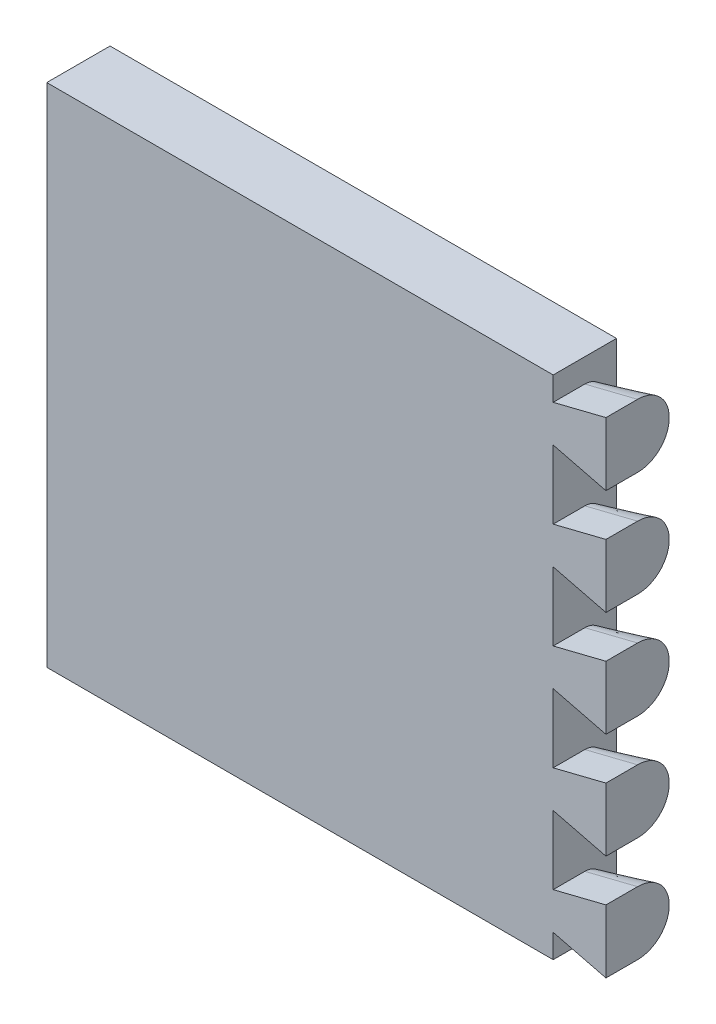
ISO-10303-21;
HEADER;
FILE_DESCRIPTION(('STEP AP214'),'2;1');
FILE_NAME('part.step','',(''),(''),'','','');
FILE_SCHEMA(('AUTOMOTIVE_DESIGN { 1 0 10303 214 1 1 1 1 }'));
ENDSEC;
DATA;
#1=APPLICATION_CONTEXT('core data for automotive mechanical design processes');
#2=APPLICATION_PROTOCOL_DEFINITION('international standard','automotive_design',2000,#1);
#3=PRODUCT_CONTEXT('',#1,'mechanical');
#4=PRODUCT('Part','Part','',(#3));
#5=PRODUCT_RELATED_PRODUCT_CATEGORY('part','',(#4));
#6=PRODUCT_DEFINITION_FORMATION('','',#4);
#7=PRODUCT_DEFINITION_CONTEXT('part definition',#1,'design');
#8=PRODUCT_DEFINITION('design','',#6,#7);
#9=PRODUCT_DEFINITION_SHAPE('','',#8);
#10=(LENGTH_UNIT() NAMED_UNIT(*) SI_UNIT(.MILLI.,.METRE.));
#11=(NAMED_UNIT(*) PLANE_ANGLE_UNIT() SI_UNIT($,.RADIAN.));
#12=(NAMED_UNIT(*) SI_UNIT($,.STERADIAN.) SOLID_ANGLE_UNIT());
#13=UNCERTAINTY_MEASURE_WITH_UNIT(LENGTH_MEASURE(1.E-05),#10,'distance_accuracy_value','');
#14=(GEOMETRIC_REPRESENTATION_CONTEXT(3) GLOBAL_UNCERTAINTY_ASSIGNED_CONTEXT((#13)) GLOBAL_UNIT_ASSIGNED_CONTEXT((#10,
#11,#12)) REPRESENTATION_CONTEXT('',''));
#15=CARTESIAN_POINT('',(0.,0.,0.));
#16=DIRECTION('',(0.,0.,1.));
#17=DIRECTION('',(1.,0.,0.));
#18=AXIS2_PLACEMENT_3D('',#15,#16,#17);
#19=CARTESIAN_POINT('',(76.2,-76.2,-9.52500000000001));
#20=DIRECTION('',(1.,0.,0.));
#21=DIRECTION('',(0.,0.,-1.));
#22=AXIS2_PLACEMENT_3D('',#19,#20,#21);
#23=PLANE('',#22);
#24=DIRECTION('',(0.,0.,1.));
#25=VECTOR('',#24,1.);
#26=CARTESIAN_POINT('',(76.2,-69.0669179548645,9.52499999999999));
#27=LINE('',#26,#25);
#28=CARTESIAN_POINT('',(76.2,-69.0669179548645,0.));
#29=VERTEX_POINT('',#28);
#30=CARTESIAN_POINT('',(76.2,-69.0669179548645,9.52499999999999));
#31=VERTEX_POINT('',#30);
#32=EDGE_CURVE('E246',#29,#31,#27,.T.);
#33=ORIENTED_EDGE('',*,*,#32,.T.);
#34=DIRECTION('',(0.,1.,0.));
#35=VECTOR('',#34,1.);
#36=CARTESIAN_POINT('',(76.2,-76.2,9.52499999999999));
#37=LINE('',#36,#35);
#38=CARTESIAN_POINT('',(76.2,-76.2,9.52499999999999));
#39=VERTEX_POINT('',#38);
#40=EDGE_CURVE('E243',#39,#31,#37,.T.);
#41=ORIENTED_EDGE('',*,*,#40,.F.);
#42=DIRECTION('',(0.,0.,-1.));
#43=VECTOR('',#42,1.);
#44=CARTESIAN_POINT('',(76.2,-76.2,9.52499999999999));
#45=LINE('',#44,#43);
#46=CARTESIAN_POINT('',(76.2,-76.2,-9.52500000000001));
#47=VERTEX_POINT('',#46);
#48=EDGE_CURVE('E335',#39,#47,#45,.T.);
#49=ORIENTED_EDGE('',*,*,#48,.T.);
#50=DIRECTION('',(0.,-1.,0.));
#51=VECTOR('',#50,1.);
#52=CARTESIAN_POINT('',(76.2,76.2,-9.525));
#53=LINE('',#52,#51);
#54=CARTESIAN_POINT('',(76.2,-63.5,-9.52500000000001));
#55=VERTEX_POINT('',#54);
#56=EDGE_CURVE('E332',#55,#47,#53,.T.);
#57=ORIENTED_EDGE('',*,*,#56,.F.);
#58=CARTESIAN_POINT('',(76.2,-63.5,-9.52500000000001));
#59=DIRECTION('',(0.,0.,1.));
#60=VECTOR('',#59,1.);
#61=LINE('',#58,#60);
#62=CARTESIAN_POINT('',(76.2,-63.5,-5.5669179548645));
#63=VERTEX_POINT('',#62);
#64=EDGE_CURVE('E11',#55,#63,#61,.T.);
#65=ORIENTED_EDGE('',*,*,#64,.T.);
#66=CARTESIAN_POINT('',(76.2,-63.5,0.));
#67=DIRECTION('',(1.,0.,0.));
#68=DIRECTION('',(0.,0.,-1.));
#69=AXIS2_PLACEMENT_3D('',#66,#67,#68);
#70=CIRCLE('',#69,5.5669179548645);
#71=EDGE_CURVE('E808',#63,#29,#70,.F.);
#72=ORIENTED_EDGE('',*,*,#71,.T.);
#73=EDGE_LOOP('',(#33,#41,#49,#57,#65,#72));
#74=FACE_BOUND('',#73,.T.);
#75=ADVANCED_FACE('F32',(#74),#23,.T.);
#76=CARTESIAN_POINT('',(76.2,-63.5,0.));
#77=DIRECTION('',(1.,0.,0.));
#78=DIRECTION('',(0.,0.,-1.));
#79=AXIS2_PLACEMENT_3D('',#76,#77,#78);
#80=CIRCLE('',#79,5.5669179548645);
#81=CARTESIAN_POINT('',(76.2,-57.9330820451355,0.));
#82=VERTEX_POINT('',#81);
#83=EDGE_CURVE('E52',#82,#63,#80,.F.);
#84=ORIENTED_EDGE('',*,*,#83,.T.);
#85=ORIENTED_EDGE('',*,*,#64,.F.);
#86=CARTESIAN_POINT('',(76.2,-31.75,-9.52500000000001));
#87=VERTEX_POINT('',#86);
#88=EDGE_CURVE('E360',#87,#55,#53,.T.);
#89=ORIENTED_EDGE('',*,*,#88,.F.);
#90=CARTESIAN_POINT('',(76.2,-31.75,-9.52500000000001));
#91=DIRECTION('',(0.,0.,1.));
#92=VECTOR('',#91,1.);
#93=LINE('',#90,#92);
#94=CARTESIAN_POINT('',(76.2,-31.75,-5.5669179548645));
#95=VERTEX_POINT('',#94);
#96=EDGE_CURVE('E44',#87,#95,#93,.T.);
#97=ORIENTED_EDGE('',*,*,#96,.T.);
#98=CARTESIAN_POINT('',(76.2,-31.75,0.));
#99=DIRECTION('',(1.,0.,0.));
#100=DIRECTION('',(0.,0.,-1.));
#101=AXIS2_PLACEMENT_3D('',#98,#99,#100);
#102=CIRCLE('',#101,5.5669179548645);
#103=CARTESIAN_POINT('',(76.2,-37.3169179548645,0.));
#104=VERTEX_POINT('',#103);
#105=EDGE_CURVE('E366',#95,#104,#102,.F.);
#106=ORIENTED_EDGE('',*,*,#105,.T.);
#107=DIRECTION('',(0.,0.,1.));
#108=VECTOR('',#107,1.);
#109=CARTESIAN_POINT('',(76.2,-37.3169179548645,9.52499999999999));
#110=LINE('',#109,#108);
#111=CARTESIAN_POINT('',(76.2,-37.3169179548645,9.52499999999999));
#112=VERTEX_POINT('',#111);
#113=EDGE_CURVE('E371',#104,#112,#110,.T.);
#114=ORIENTED_EDGE('',*,*,#113,.T.);
#115=CARTESIAN_POINT('',(76.2,-57.9330820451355,9.52499999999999));
#116=VERTEX_POINT('',#115);
#117=EDGE_CURVE('E467',#116,#112,#37,.T.);
#118=ORIENTED_EDGE('',*,*,#117,.F.);
#119=DIRECTION('',(0.,0.,-1.));
#120=VECTOR('',#119,1.);
#121=CARTESIAN_POINT('',(76.2,-57.9330820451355,9.52499999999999));
#122=LINE('',#121,#120);
#123=EDGE_CURVE('E278',#116,#82,#122,.T.);
#124=ORIENTED_EDGE('',*,*,#123,.T.);
#125=EDGE_LOOP('',(#84,#85,#89,#97,#106,#114,#118,#124));
#126=FACE_BOUND('',#125,.T.);
#127=ADVANCED_FACE('F442',(#126),#23,.T.);
#128=DIRECTION('',(0.,0.,1.));
#129=VECTOR('',#128,1.);
#130=CARTESIAN_POINT('',(76.2,57.9330820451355,9.52499999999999));
#131=LINE('',#130,#129);
#132=CARTESIAN_POINT('',(76.2,57.9330820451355,0.));
#133=VERTEX_POINT('',#132);
#134=CARTESIAN_POINT('',(76.2,57.9330820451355,9.52499999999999));
#135=VERTEX_POINT('',#134);
#136=EDGE_CURVE('E553',#133,#135,#131,.T.);
#137=ORIENTED_EDGE('',*,*,#136,.T.);
#138=CARTESIAN_POINT('',(76.2,37.3169179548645,9.52499999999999));
#139=VERTEX_POINT('',#138);
#140=EDGE_CURVE('E460',#139,#135,#37,.T.);
#141=ORIENTED_EDGE('',*,*,#140,.F.);
#142=DIRECTION('',(0.,0.,-1.));
#143=VECTOR('',#142,1.);
#144=CARTESIAN_POINT('',(76.2,37.3169179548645,9.52499999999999));
#145=LINE('',#144,#143);
#146=CARTESIAN_POINT('',(76.2,37.3169179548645,0.));
#147=VERTEX_POINT('',#146);
#148=EDGE_CURVE('E496',#139,#147,#145,.T.);
#149=ORIENTED_EDGE('',*,*,#148,.T.);
#150=CARTESIAN_POINT('',(76.2,31.75,0.));
#151=DIRECTION('',(1.,0.,0.));
#152=DIRECTION('',(0.,0.,-1.));
#153=AXIS2_PLACEMENT_3D('',#150,#151,#152);
#154=CIRCLE('',#153,5.5669179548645);
#155=CARTESIAN_POINT('',(76.2,31.75,-5.5669179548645));
#156=VERTEX_POINT('',#155);
#157=EDGE_CURVE('E527',#147,#156,#154,.F.);
#158=ORIENTED_EDGE('',*,*,#157,.T.);
#159=CARTESIAN_POINT('',(76.2,31.75,-9.525));
#160=DIRECTION('',(0.,0.,1.));
#161=VECTOR('',#160,1.);
#162=LINE('',#159,#161);
#163=CARTESIAN_POINT('',(76.2,31.75,-9.525));
#164=VERTEX_POINT('',#163);
#165=EDGE_CURVE('E785',#164,#156,#162,.T.);
#166=ORIENTED_EDGE('',*,*,#165,.F.);
#167=CARTESIAN_POINT('',(76.2,63.5,-9.525));
#168=VERTEX_POINT('',#167);
#169=EDGE_CURVE('E352',#168,#164,#53,.T.);
#170=ORIENTED_EDGE('',*,*,#169,.F.);
#171=CARTESIAN_POINT('',(76.2,63.5,-9.525));
#172=DIRECTION('',(0.,0.,1.));
#173=VECTOR('',#172,1.);
#174=LINE('',#171,#173);
#175=CARTESIAN_POINT('',(76.2,63.5,-5.5669179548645));
#176=VERTEX_POINT('',#175);
#177=EDGE_CURVE('E784',#168,#176,#174,.T.);
#178=ORIENTED_EDGE('',*,*,#177,.T.);
#179=CARTESIAN_POINT('',(76.2,63.5,0.));
#180=DIRECTION('',(1.,0.,0.));
#181=DIRECTION('',(0.,0.,-1.));
#182=AXIS2_PLACEMENT_3D('',#179,#180,#181);
#183=CIRCLE('',#182,5.5669179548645);
#184=EDGE_CURVE('E556',#176,#133,#183,.F.);
#185=ORIENTED_EDGE('',*,*,#184,.T.);
#186=EDGE_LOOP('',(#137,#141,#149,#158,#166,#170,#178,#185));
#187=FACE_BOUND('',#186,.T.);
#188=ADVANCED_FACE('F551',(#187),#23,.T.);
#189=DIRECTION('',(0.,0.,1.));
#190=VECTOR('',#189,1.);
#191=CARTESIAN_POINT('',(76.2,26.1830820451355,9.52499999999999));
#192=LINE('',#191,#190);
#193=CARTESIAN_POINT('',(76.2,26.1830820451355,0.));
#194=VERTEX_POINT('',#193);
#195=CARTESIAN_POINT('',(76.2,26.1830820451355,9.52499999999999));
#196=VERTEX_POINT('',#195);
#197=EDGE_CURVE('E519',#194,#196,#192,.T.);
#198=ORIENTED_EDGE('',*,*,#197,.T.);
#199=CARTESIAN_POINT('',(76.2,5.5669179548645,9.52499999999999));
#200=VERTEX_POINT('',#199);
#201=EDGE_CURVE('E465',#200,#196,#37,.T.);
#202=ORIENTED_EDGE('',*,*,#201,.F.);
#203=DIRECTION('',(0.,0.,-1.));
#204=VECTOR('',#203,1.);
#205=CARTESIAN_POINT('',(76.2,5.5669179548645,9.52499999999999));
#206=LINE('',#205,#204);
#207=CARTESIAN_POINT('',(76.2,5.5669179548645,0.));
#208=VERTEX_POINT('',#207);
#209=EDGE_CURVE('E492',#200,#208,#206,.T.);
#210=ORIENTED_EDGE('',*,*,#209,.T.);
#211=CARTESIAN_POINT('',(76.2,0.,0.));
#212=DIRECTION('',(1.,0.,0.));
#213=DIRECTION('',(0.,0.,-1.));
#214=AXIS2_PLACEMENT_3D('',#211,#212,#213);
#215=CIRCLE('',#214,5.5669179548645);
#216=CARTESIAN_POINT('',(76.2,0.,-5.5669179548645));
#217=VERTEX_POINT('',#216);
#218=EDGE_CURVE('E495',#208,#217,#215,.F.);
#219=ORIENTED_EDGE('',*,*,#218,.T.);
#220=CARTESIAN_POINT('',(76.2,0.,-9.52500000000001));
#221=DIRECTION('',(0.,0.,1.));
#222=VECTOR('',#221,1.);
#223=LINE('',#220,#222);
#224=CARTESIAN_POINT('',(76.2,0.,-9.52500000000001));
#225=VERTEX_POINT('',#224);
#226=EDGE_CURVE('E786',#225,#217,#223,.T.);
#227=ORIENTED_EDGE('',*,*,#226,.F.);
#228=EDGE_CURVE('E347',#164,#225,#53,.T.);
#229=ORIENTED_EDGE('',*,*,#228,.F.);
#230=ORIENTED_EDGE('',*,*,#165,.T.);
#231=CARTESIAN_POINT('',(76.2,31.75,0.));
#232=DIRECTION('',(1.,0.,0.));
#233=DIRECTION('',(0.,0.,-1.));
#234=AXIS2_PLACEMENT_3D('',#231,#232,#233);
#235=CIRCLE('',#234,5.5669179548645);
#236=EDGE_CURVE('E522',#156,#194,#235,.F.);
#237=ORIENTED_EDGE('',*,*,#236,.T.);
#238=EDGE_LOOP('',(#198,#202,#210,#219,#227,#229,#230,#237));
#239=FACE_BOUND('',#238,.T.);
#240=ADVANCED_FACE('F389',(#239),#23,.T.);
#241=CARTESIAN_POINT('',(76.2,-31.75,0.));
#242=DIRECTION('',(1.,0.,0.));
#243=DIRECTION('',(0.,0.,-1.));
#244=AXIS2_PLACEMENT_3D('',#241,#242,#243);
#245=CIRCLE('',#244,5.5669179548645);
#246=CARTESIAN_POINT('',(76.2,-26.1830820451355,0.));
#247=VERTEX_POINT('',#246);
#248=EDGE_CURVE('E111',#247,#95,#245,.F.);
#249=ORIENTED_EDGE('',*,*,#248,.T.);
#250=ORIENTED_EDGE('',*,*,#96,.F.);
#251=EDGE_CURVE('E340',#225,#87,#53,.T.);
#252=ORIENTED_EDGE('',*,*,#251,.F.);
#253=ORIENTED_EDGE('',*,*,#226,.T.);
#254=CARTESIAN_POINT('',(76.2,0.,0.));
#255=DIRECTION('',(1.,0.,0.));
#256=DIRECTION('',(0.,0.,-1.));
#257=AXIS2_PLACEMENT_3D('',#254,#255,#256);
#258=CIRCLE('',#257,5.5669179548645);
#259=CARTESIAN_POINT('',(76.2,-5.5669179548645,0.));
#260=VERTEX_POINT('',#259);
#261=EDGE_CURVE('E483',#217,#260,#258,.F.);
#262=ORIENTED_EDGE('',*,*,#261,.T.);
#263=DIRECTION('',(0.,0.,1.));
#264=VECTOR('',#263,1.);
#265=CARTESIAN_POINT('',(76.2,-5.5669179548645,9.52499999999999));
#266=LINE('',#265,#264);
#267=CARTESIAN_POINT('',(76.2,-5.5669179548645,9.52499999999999));
#268=VERTEX_POINT('',#267);
#269=EDGE_CURVE('E497',#260,#268,#266,.T.);
#270=ORIENTED_EDGE('',*,*,#269,.T.);
#271=CARTESIAN_POINT('',(76.2,-26.1830820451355,9.52499999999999));
#272=VERTEX_POINT('',#271);
#273=EDGE_CURVE('E461',#272,#268,#37,.T.);
#274=ORIENTED_EDGE('',*,*,#273,.F.);
#275=DIRECTION('',(0.,0.,-1.));
#276=VECTOR('',#275,1.);
#277=CARTESIAN_POINT('',(76.2,-26.1830820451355,9.52499999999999));
#278=LINE('',#277,#276);
#279=EDGE_CURVE('E292',#272,#247,#278,.T.);
#280=ORIENTED_EDGE('',*,*,#279,.T.);
#281=EDGE_LOOP('',(#249,#250,#252,#253,#262,#270,#274,#280));
#282=FACE_BOUND('',#281,.T.);
#283=ADVANCED_FACE('F378',(#282),#23,.T.);
#284=CARTESIAN_POINT('',(76.2,63.5,0.));
#285=DIRECTION('',(1.,0.,0.));
#286=DIRECTION('',(0.,0.,-1.));
#287=AXIS2_PLACEMENT_3D('',#284,#285,#286);
#288=CIRCLE('',#287,5.5669179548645);
#289=CARTESIAN_POINT('',(76.2,69.0669179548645,0.));
#290=VERTEX_POINT('',#289);
#291=EDGE_CURVE('E561',#290,#176,#288,.F.);
#292=ORIENTED_EDGE('',*,*,#291,.T.);
#293=ORIENTED_EDGE('',*,*,#177,.F.);
#294=CARTESIAN_POINT('',(76.2,76.2,-9.525));
#295=VERTEX_POINT('',#294);
#296=EDGE_CURVE('E356',#295,#168,#53,.T.);
#297=ORIENTED_EDGE('',*,*,#296,.F.);
#298=DIRECTION('',(0.,0.,1.));
#299=VECTOR('',#298,1.);
#300=CARTESIAN_POINT('',(76.2,76.2,-9.525));
#301=LINE('',#300,#299);
#302=CARTESIAN_POINT('',(76.2,76.2,9.52499999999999));
#303=VERTEX_POINT('',#302);
#304=EDGE_CURVE('E473',#295,#303,#301,.T.);
#305=ORIENTED_EDGE('',*,*,#304,.T.);
#306=CARTESIAN_POINT('',(76.2,69.0669179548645,9.52499999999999));
#307=VERTEX_POINT('',#306);
#308=EDGE_CURVE('E459',#307,#303,#37,.T.);
#309=ORIENTED_EDGE('',*,*,#308,.F.);
#310=DIRECTION('',(0.,0.,-1.));
#311=VECTOR('',#310,1.);
#312=CARTESIAN_POINT('',(76.2,69.0669179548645,9.52499999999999));
#313=LINE('',#312,#311);
#314=EDGE_CURVE('E306',#307,#290,#313,.T.);
#315=ORIENTED_EDGE('',*,*,#314,.T.);
#316=EDGE_LOOP('',(#292,#293,#297,#305,#309,#315));
#317=FACE_BOUND('',#316,.T.);
#318=ADVANCED_FACE('F388',(#317),#23,.T.);
#319=CARTESIAN_POINT('',(76.2,76.2,-9.525));
#320=DIRECTION('',(0.,0.,-1.));
#321=DIRECTION('',(0.,1.,0.));
#322=AXIS2_PLACEMENT_3D('',#319,#320,#321);
#323=PLANE('',#322);
#324=DIRECTION('',(0.,-1.,0.));
#325=VECTOR('',#324,1.);
#326=CARTESIAN_POINT('',(-76.2,76.2,-9.525));
#327=LINE('',#326,#325);
#328=CARTESIAN_POINT('',(-76.2,76.2,-9.525));
#329=VERTEX_POINT('',#328);
#330=CARTESIAN_POINT('',(-76.2,-76.2,-9.52500000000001));
#331=VERTEX_POINT('',#330);
#332=EDGE_CURVE('E310',#329,#331,#327,.T.);
#333=ORIENTED_EDGE('',*,*,#332,.F.);
#334=DIRECTION('',(-1.,0.,0.));
#335=VECTOR('',#334,1.);
#336=CARTESIAN_POINT('',(76.2,76.2,-9.525));
#337=LINE('',#336,#335);
#338=EDGE_CURVE('E481',#295,#329,#337,.T.);
#339=ORIENTED_EDGE('',*,*,#338,.F.);
#340=ORIENTED_EDGE('',*,*,#296,.T.);
#341=ORIENTED_EDGE('',*,*,#169,.T.);
#342=ORIENTED_EDGE('',*,*,#228,.T.);
#343=ORIENTED_EDGE('',*,*,#251,.T.);
#344=ORIENTED_EDGE('',*,*,#88,.T.);
#345=ORIENTED_EDGE('',*,*,#56,.T.);
#346=DIRECTION('',(-1.,0.,0.));
#347=VECTOR('',#346,1.);
#348=CARTESIAN_POINT('',(76.2,-76.2,-9.52500000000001));
#349=LINE('',#348,#347);
#350=EDGE_CURVE('E474',#47,#331,#349,.T.);
#351=ORIENTED_EDGE('',*,*,#350,.T.);
#352=EDGE_LOOP('',(#333,#339,#340,#341,#342,#343,#344,#345,#351));
#353=FACE_BOUND('',#352,.T.);
#354=ADVANCED_FACE('F451',(#353),#323,.T.);
#355=CARTESIAN_POINT('',(76.2,76.2,-9.525));
#356=DIRECTION('',(0.,-1.,0.));
#357=DIRECTION('',(0.,0.,-1.));
#358=AXIS2_PLACEMENT_3D('',#355,#356,#357);
#359=PLANE('',#358);
#360=DIRECTION('',(0.,0.,1.));
#361=VECTOR('',#360,1.);
#362=CARTESIAN_POINT('',(-76.2,76.2,-9.525));
#363=LINE('',#362,#361);
#364=CARTESIAN_POINT('',(-76.2,76.2,9.52499999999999));
#365=VERTEX_POINT('',#364);
#366=EDGE_CURVE('E329',#329,#365,#363,.T.);
#367=ORIENTED_EDGE('',*,*,#366,.T.);
#368=DIRECTION('',(-1.,0.,0.));
#369=VECTOR('',#368,1.);
#370=CARTESIAN_POINT('',(76.2,76.2,9.52499999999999));
#371=LINE('',#370,#369);
#372=EDGE_CURVE('E484',#303,#365,#371,.T.);
#373=ORIENTED_EDGE('',*,*,#372,.F.);
#374=ORIENTED_EDGE('',*,*,#304,.F.);
#375=ORIENTED_EDGE('',*,*,#338,.T.);
#376=EDGE_LOOP('',(#367,#373,#374,#375));
#377=FACE_BOUND('',#376,.T.);
#378=ADVANCED_FACE('F392',(#377),#359,.F.);
#379=CARTESIAN_POINT('',(76.2,-76.2,9.52499999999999));
#380=DIRECTION('',(0.,0.,1.));
#381=DIRECTION('',(1.,0.,0.));
#382=AXIS2_PLACEMENT_3D('',#379,#380,#381);
#383=PLANE('',#382);
#384=DIRECTION('',(0.,1.,0.));
#385=VECTOR('',#384,1.);
#386=CARTESIAN_POINT('',(-76.2,-76.2,9.52499999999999));
#387=LINE('',#386,#385);
#388=CARTESIAN_POINT('',(-76.2,-76.2,9.52499999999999));
#389=VERTEX_POINT('',#388);
#390=EDGE_CURVE('E326',#389,#365,#387,.T.);
#391=ORIENTED_EDGE('',*,*,#390,.F.);
#392=DIRECTION('',(-1.,0.,0.));
#393=VECTOR('',#392,1.);
#394=CARTESIAN_POINT('',(76.2,-76.2,9.52499999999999));
#395=LINE('',#394,#393);
#396=EDGE_CURVE('E478',#39,#389,#395,.T.);
#397=ORIENTED_EDGE('',*,*,#396,.F.);
#398=ORIENTED_EDGE('',*,*,#40,.T.);
#399=DIRECTION('',(0.970295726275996,-0.241921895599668,0.));
#400=VECTOR('',#399,1.);
#401=CARTESIAN_POINT('',(77.8743895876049,-69.4843901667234,9.52499999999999));
#402=LINE('',#401,#400);
#403=CARTESIAN_POINT('',(92.075,-73.025,9.52499999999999));
#404=VERTEX_POINT('',#403);
#405=EDGE_CURVE('E236',#31,#404,#402,.T.);
#406=ORIENTED_EDGE('',*,*,#405,.T.);
#407=DIRECTION('',(0.,-1.,0.));
#408=VECTOR('',#407,1.);
#409=CARTESIAN_POINT('',(92.075,-73.025,9.52499999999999));
#410=LINE('',#409,#408);
#411=CARTESIAN_POINT('',(92.075,-53.975,9.52499999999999));
#412=VERTEX_POINT('',#411);
#413=EDGE_CURVE('E241',#412,#404,#410,.T.);
#414=ORIENTED_EDGE('',*,*,#413,.F.);
#415=DIRECTION('',(0.970295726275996,0.241921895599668,0.));
#416=VECTOR('',#415,1.);
#417=CARTESIAN_POINT('',(92.075,-53.975,9.52499999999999));
#418=LINE('',#417,#416);
#419=EDGE_CURVE('E75',#116,#412,#418,.T.);
#420=ORIENTED_EDGE('',*,*,#419,.F.);
#421=ORIENTED_EDGE('',*,*,#117,.T.);
#422=DIRECTION('',(0.970295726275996,-0.241921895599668,0.));
#423=VECTOR('',#422,1.);
#424=CARTESIAN_POINT('',(85.3272506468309,-39.592597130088,9.52499999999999));
#425=LINE('',#424,#423);
#426=CARTESIAN_POINT('',(92.075,-41.275,9.52499999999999));
#427=VERTEX_POINT('',#426);
#428=EDGE_CURVE('E798',#112,#427,#425,.T.);
#429=ORIENTED_EDGE('',*,*,#428,.T.);
#430=DIRECTION('',(0.,-1.,0.));
#431=VECTOR('',#430,1.);
#432=CARTESIAN_POINT('',(92.075,-41.275,9.52499999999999));
#433=LINE('',#432,#431);
#434=CARTESIAN_POINT('',(92.075,-22.225,9.52499999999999));
#435=VERTEX_POINT('',#434);
#436=EDGE_CURVE('E275',#435,#427,#433,.T.);
#437=ORIENTED_EDGE('',*,*,#436,.F.);
#438=DIRECTION('',(0.970295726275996,0.241921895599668,0.));
#439=VECTOR('',#438,1.);
#440=CARTESIAN_POINT('',(92.075,-22.225,9.52499999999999));
#441=LINE('',#440,#439);
#442=EDGE_CURVE('E85',#272,#435,#441,.T.);
#443=ORIENTED_EDGE('',*,*,#442,.F.);
#444=ORIENTED_EDGE('',*,*,#273,.T.);
#445=DIRECTION('',(0.970295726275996,-0.241921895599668,0.));
#446=VECTOR('',#445,1.);
#447=CARTESIAN_POINT('',(92.7801117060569,-9.70080409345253,9.52499999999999));
#448=LINE('',#447,#446);
#449=CARTESIAN_POINT('',(92.075,-9.525,9.52499999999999));
#450=VERTEX_POINT('',#449);
#451=EDGE_CURVE('E491',#268,#450,#448,.T.);
#452=ORIENTED_EDGE('',*,*,#451,.T.);
#453=DIRECTION('',(0.,-1.,0.));
#454=VECTOR('',#453,1.);
#455=CARTESIAN_POINT('',(92.075,-9.525,9.52499999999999));
#456=LINE('',#455,#454);
#457=CARTESIAN_POINT('',(92.075,9.525,9.52499999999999));
#458=VERTEX_POINT('',#457);
#459=EDGE_CURVE('E307',#458,#450,#456,.T.);
#460=ORIENTED_EDGE('',*,*,#459,.F.);
#461=DIRECTION('',(0.970295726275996,0.241921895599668,0.));
#462=VECTOR('',#461,1.);
#463=CARTESIAN_POINT('',(92.075,9.525,9.52499999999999));
#464=LINE('',#463,#462);
#465=EDGE_CURVE('E320',#200,#458,#464,.T.);
#466=ORIENTED_EDGE('',*,*,#465,.F.);
#467=ORIENTED_EDGE('',*,*,#201,.T.);
#468=DIRECTION('',(0.970295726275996,-0.241921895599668,0.));
#469=VECTOR('',#468,1.);
#470=CARTESIAN_POINT('',(100.232972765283,20.1909889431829,9.52499999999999));
#471=LINE('',#470,#469);
#472=CARTESIAN_POINT('',(92.075,22.225,9.52499999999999));
#473=VERTEX_POINT('',#472);
#474=EDGE_CURVE('E525',#196,#473,#471,.T.);
#475=ORIENTED_EDGE('',*,*,#474,.T.);
#476=DIRECTION('',(0.,-1.,0.));
#477=VECTOR('',#476,1.);
#478=CARTESIAN_POINT('',(92.075,22.225,9.52499999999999));
#479=LINE('',#478,#477);
#480=CARTESIAN_POINT('',(92.075,41.275,9.52499999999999));
#481=VERTEX_POINT('',#480);
#482=EDGE_CURVE('E303',#481,#473,#479,.T.);
#483=ORIENTED_EDGE('',*,*,#482,.F.);
#484=DIRECTION('',(0.970295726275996,0.241921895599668,0.));
#485=VECTOR('',#484,1.);
#486=CARTESIAN_POINT('',(92.075,41.275,9.52499999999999));
#487=LINE('',#486,#485);
#488=EDGE_CURVE('E296',#139,#481,#487,.T.);
#489=ORIENTED_EDGE('',*,*,#488,.F.);
#490=ORIENTED_EDGE('',*,*,#140,.T.);
#491=DIRECTION('',(0.970295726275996,-0.241921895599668,0.));
#492=VECTOR('',#491,1.);
#493=CARTESIAN_POINT('',(107.685833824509,50.0827819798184,9.52499999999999));
#494=LINE('',#493,#492);
#495=CARTESIAN_POINT('',(92.075,53.975,9.52499999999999));
#496=VERTEX_POINT('',#495);
#497=EDGE_CURVE('E559',#135,#496,#494,.T.);
#498=ORIENTED_EDGE('',*,*,#497,.T.);
#499=DIRECTION('',(0.,-1.,0.));
#500=VECTOR('',#499,1.);
#501=CARTESIAN_POINT('',(92.075,53.975,9.52499999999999));
#502=LINE('',#501,#500);
#503=CARTESIAN_POINT('',(92.075,73.025,9.52499999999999));
#504=VERTEX_POINT('',#503);
#505=EDGE_CURVE('E289',#504,#496,#502,.T.);
#506=ORIENTED_EDGE('',*,*,#505,.F.);
#507=DIRECTION('',(0.970295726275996,0.241921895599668,0.));
#508=VECTOR('',#507,1.);
#509=CARTESIAN_POINT('',(92.075,73.025,9.52499999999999));
#510=LINE('',#509,#508);
#511=EDGE_CURVE('E282',#307,#504,#510,.T.);
#512=ORIENTED_EDGE('',*,*,#511,.F.);
#513=ORIENTED_EDGE('',*,*,#308,.T.);
#514=ORIENTED_EDGE('',*,*,#372,.T.);
#515=EDGE_LOOP('',(#391,#397,#398,#406,#414,#420,#421,#429,#437,#443,#444,#452,#460,#466,#467,
#475,#483,#489,#490,#498,#506,#512,#513,#514));
#516=FACE_BOUND('',#515,.T.);
#517=ADVANCED_FACE('F239',(#516),#383,.T.);
#518=CARTESIAN_POINT('',(76.2,-76.2,9.52499999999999));
#519=DIRECTION('',(0.,1.,0.));
#520=DIRECTION('',(0.,0.,1.));
#521=AXIS2_PLACEMENT_3D('',#518,#519,#520);
#522=PLANE('',#521);
#523=DIRECTION('',(0.,0.,-1.));
#524=VECTOR('',#523,1.);
#525=CARTESIAN_POINT('',(-76.2,-76.2,9.52499999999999));
#526=LINE('',#525,#524);
#527=EDGE_CURVE('E323',#389,#331,#526,.T.);
#528=ORIENTED_EDGE('',*,*,#527,.T.);
#529=ORIENTED_EDGE('',*,*,#350,.F.);
#530=ORIENTED_EDGE('',*,*,#48,.F.);
#531=ORIENTED_EDGE('',*,*,#396,.T.);
#532=EDGE_LOOP('',(#528,#529,#530,#531));
#533=FACE_BOUND('',#532,.T.);
#534=ADVANCED_FACE('F628',(#533),#522,.F.);
#535=CARTESIAN_POINT('',(-76.2,-76.2,-9.52500000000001));
#536=DIRECTION('',(1.,0.,0.));
#537=DIRECTION('',(0.,0.,-1.));
#538=AXIS2_PLACEMENT_3D('',#535,#536,#537);
#539=PLANE('',#538);
#540=ORIENTED_EDGE('',*,*,#332,.T.);
#541=ORIENTED_EDGE('',*,*,#527,.F.);
#542=ORIENTED_EDGE('',*,*,#390,.T.);
#543=ORIENTED_EDGE('',*,*,#366,.F.);
#544=EDGE_LOOP('',(#540,#541,#542,#543));
#545=FACE_BOUND('',#544,.T.);
#546=ADVANCED_FACE('F390',(#545),#539,.F.);
#547=CARTESIAN_POINT('',(92.075,-9.525,9.52499999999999));
#548=DIRECTION('',(-0.241921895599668,-0.970295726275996,0.));
#549=DIRECTION('',(0.970295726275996,-0.241921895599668,0.));
#550=AXIS2_PLACEMENT_3D('',#547,#548,#549);
#551=PLANE('',#550);
#552=ORIENTED_EDGE('',*,*,#269,.F.);
#553=DIRECTION('',(0.970295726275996,-0.241921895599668,0.));
#554=VECTOR('',#553,1.);
#555=CARTESIAN_POINT('',(92.075,-9.525,0.));
#556=LINE('',#555,#554);
#557=CARTESIAN_POINT('',(92.075,-9.525,0.));
#558=VERTEX_POINT('',#557);
#559=EDGE_CURVE('E489',#260,#558,#556,.T.);
#560=ORIENTED_EDGE('',*,*,#559,.T.);
#561=DIRECTION('',(0.,0.,-1.));
#562=VECTOR('',#561,1.);
#563=CARTESIAN_POINT('',(92.075,-9.525,9.52499999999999));
#564=LINE('',#563,#562);
#565=EDGE_CURVE('E317',#450,#558,#564,.T.);
#566=ORIENTED_EDGE('',*,*,#565,.F.);
#567=ORIENTED_EDGE('',*,*,#451,.F.);
#568=EDGE_LOOP('',(#552,#560,#566,#567));
#569=FACE_BOUND('',#568,.T.);
#570=ADVANCED_FACE('F511',(#569),#551,.T.);
#571=CARTESIAN_POINT('',(92.075,0.,0.));
#572=DIRECTION('',(1.,0.,0.));
#573=DIRECTION('',(0.,0.,-1.));
#574=AXIS2_PLACEMENT_3D('',#571,#572,#573);
#575=CONICAL_SURFACE('',#574,9.525,0.244346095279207);
#576=ORIENTED_EDGE('',*,*,#559,.F.);
#577=ORIENTED_EDGE('',*,*,#261,.F.);
#578=ORIENTED_EDGE('',*,*,#218,.F.);
#579=DIRECTION('',(0.970295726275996,0.241921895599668,0.));
#580=VECTOR('',#579,1.);
#581=CARTESIAN_POINT('',(92.075,9.525,0.));
#582=LINE('',#581,#580);
#583=CARTESIAN_POINT('',(92.075,9.525,0.));
#584=VERTEX_POINT('',#583);
#585=EDGE_CURVE('E487',#208,#584,#582,.T.);
#586=ORIENTED_EDGE('',*,*,#585,.T.);
#587=CARTESIAN_POINT('',(92.075,0.,0.));
#588=DIRECTION('',(1.,0.,0.));
#589=DIRECTION('',(0.,0.,-1.));
#590=AXIS2_PLACEMENT_3D('',#587,#588,#589);
#591=CIRCLE('',#590,9.525);
#592=EDGE_CURVE('E314',#558,#584,#591,.T.);
#593=ORIENTED_EDGE('',*,*,#592,.F.);
#594=EDGE_LOOP('',(#576,#577,#578,#586,#593));
#595=FACE_BOUND('',#594,.T.);
#596=ADVANCED_FACE('F515',(#595),#575,.T.);
#597=CARTESIAN_POINT('',(92.075,0.,0.));
#598=DIRECTION('',(1.,0.,0.));
#599=DIRECTION('',(0.,0.,-1.));
#600=AXIS2_PLACEMENT_3D('',#597,#598,#599);
#601=PLANE('',#600);
#602=ORIENTED_EDGE('',*,*,#459,.T.);
#603=ORIENTED_EDGE('',*,*,#565,.T.);
#604=ORIENTED_EDGE('',*,*,#592,.T.);
#605=DIRECTION('',(0.,0.,1.));
#606=VECTOR('',#605,1.);
#607=CARTESIAN_POINT('',(92.075,9.525,9.52499999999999));
#608=LINE('',#607,#606);
#609=EDGE_CURVE('E311',#584,#458,#608,.T.);
#610=ORIENTED_EDGE('',*,*,#609,.T.);
#611=EDGE_LOOP('',(#602,#603,#604,#610));
#612=FACE_BOUND('',#611,.T.);
#613=ADVANCED_FACE('F506',(#612),#601,.T.);
#614=CARTESIAN_POINT('',(92.075,9.525,9.52499999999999));
#615=DIRECTION('',(-0.241921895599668,0.970295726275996,0.));
#616=DIRECTION('',(-0.970295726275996,-0.241921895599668,0.));
#617=AXIS2_PLACEMENT_3D('',#614,#615,#616);
#618=PLANE('',#617);
#619=ORIENTED_EDGE('',*,*,#209,.F.);
#620=ORIENTED_EDGE('',*,*,#465,.T.);
#621=ORIENTED_EDGE('',*,*,#609,.F.);
#622=ORIENTED_EDGE('',*,*,#585,.F.);
#623=EDGE_LOOP('',(#619,#620,#621,#622));
#624=FACE_BOUND('',#623,.T.);
#625=ADVANCED_FACE('F502',(#624),#618,.T.);
#626=CARTESIAN_POINT('',(92.075,22.225,9.52499999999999));
#627=DIRECTION('',(-0.241921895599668,-0.970295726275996,0.));
#628=DIRECTION('',(0.970295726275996,-0.241921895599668,0.));
#629=AXIS2_PLACEMENT_3D('',#626,#627,#628);
#630=PLANE('',#629);
#631=ORIENTED_EDGE('',*,*,#197,.F.);
#632=DIRECTION('',(0.970295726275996,-0.241921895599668,0.));
#633=VECTOR('',#632,1.);
#634=CARTESIAN_POINT('',(92.075,22.225,0.));
#635=LINE('',#634,#633);
#636=CARTESIAN_POINT('',(92.075,22.225,0.));
#637=VERTEX_POINT('',#636);
#638=EDGE_CURVE('E529',#194,#637,#635,.T.);
#639=ORIENTED_EDGE('',*,*,#638,.T.);
#640=DIRECTION('',(0.,0.,-1.));
#641=VECTOR('',#640,1.);
#642=CARTESIAN_POINT('',(92.075,22.225,9.52499999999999));
#643=LINE('',#642,#641);
#644=EDGE_CURVE('E293',#473,#637,#643,.T.);
#645=ORIENTED_EDGE('',*,*,#644,.F.);
#646=ORIENTED_EDGE('',*,*,#474,.F.);
#647=EDGE_LOOP('',(#631,#639,#645,#646));
#648=FACE_BOUND('',#647,.T.);
#649=ADVANCED_FACE('F541',(#648),#630,.T.);
#650=CARTESIAN_POINT('',(92.075,31.75,0.));
#651=DIRECTION('',(1.,0.,0.));
#652=DIRECTION('',(0.,0.,-1.));
#653=AXIS2_PLACEMENT_3D('',#650,#651,#652);
#654=CONICAL_SURFACE('',#653,9.525,0.244346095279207);
#655=ORIENTED_EDGE('',*,*,#638,.F.);
#656=ORIENTED_EDGE('',*,*,#236,.F.);
#657=ORIENTED_EDGE('',*,*,#157,.F.);
#658=DIRECTION('',(0.970295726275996,0.241921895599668,0.));
#659=VECTOR('',#658,1.);
#660=CARTESIAN_POINT('',(92.075,41.275,0.));
#661=LINE('',#660,#659);
#662=CARTESIAN_POINT('',(92.075,41.275,0.));
#663=VERTEX_POINT('',#662);
#664=EDGE_CURVE('E533',#147,#663,#661,.T.);
#665=ORIENTED_EDGE('',*,*,#664,.T.);
#666=CARTESIAN_POINT('',(92.075,31.75,0.));
#667=DIRECTION('',(1.,0.,0.));
#668=DIRECTION('',(0.,0.,-1.));
#669=AXIS2_PLACEMENT_3D('',#666,#667,#668);
#670=CIRCLE('',#669,9.525);
#671=EDGE_CURVE('E297',#637,#663,#670,.T.);
#672=ORIENTED_EDGE('',*,*,#671,.F.);
#673=EDGE_LOOP('',(#655,#656,#657,#665,#672));
#674=FACE_BOUND('',#673,.T.);
#675=ADVANCED_FACE('F542',(#674),#654,.T.);
#676=CARTESIAN_POINT('',(92.075,31.75,0.));
#677=DIRECTION('',(1.,0.,0.));
#678=DIRECTION('',(0.,0.,-1.));
#679=AXIS2_PLACEMENT_3D('',#676,#677,#678);
#680=PLANE('',#679);
#681=ORIENTED_EDGE('',*,*,#482,.T.);
#682=ORIENTED_EDGE('',*,*,#644,.T.);
#683=ORIENTED_EDGE('',*,*,#671,.T.);
#684=DIRECTION('',(0.,0.,1.));
#685=VECTOR('',#684,1.);
#686=CARTESIAN_POINT('',(92.075,41.275,9.52499999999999));
#687=LINE('',#686,#685);
#688=EDGE_CURVE('E300',#663,#481,#687,.T.);
#689=ORIENTED_EDGE('',*,*,#688,.T.);
#690=EDGE_LOOP('',(#681,#682,#683,#689));
#691=FACE_BOUND('',#690,.T.);
#692=ADVANCED_FACE('F544',(#691),#680,.T.);
#693=CARTESIAN_POINT('',(92.075,41.275,9.52499999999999));
#694=DIRECTION('',(-0.241921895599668,0.970295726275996,0.));
#695=DIRECTION('',(-0.970295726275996,-0.241921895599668,0.));
#696=AXIS2_PLACEMENT_3D('',#693,#694,#695);
#697=PLANE('',#696);
#698=ORIENTED_EDGE('',*,*,#148,.F.);
#699=ORIENTED_EDGE('',*,*,#488,.T.);
#700=ORIENTED_EDGE('',*,*,#688,.F.);
#701=ORIENTED_EDGE('',*,*,#664,.F.);
#702=EDGE_LOOP('',(#698,#699,#700,#701));
#703=FACE_BOUND('',#702,.T.);
#704=ADVANCED_FACE('F548',(#703),#697,.T.);
#705=CARTESIAN_POINT('',(92.075,53.975,9.52499999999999));
#706=DIRECTION('',(-0.241921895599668,-0.970295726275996,0.));
#707=DIRECTION('',(0.970295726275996,-0.241921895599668,0.));
#708=AXIS2_PLACEMENT_3D('',#705,#706,#707);
#709=PLANE('',#708);
#710=ORIENTED_EDGE('',*,*,#136,.F.);
#711=DIRECTION('',(0.970295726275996,-0.241921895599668,0.));
#712=VECTOR('',#711,1.);
#713=CARTESIAN_POINT('',(92.075,53.975,0.));
#714=LINE('',#713,#712);
#715=CARTESIAN_POINT('',(92.075,53.975,0.));
#716=VERTEX_POINT('',#715);
#717=EDGE_CURVE('E563',#133,#716,#714,.T.);
#718=ORIENTED_EDGE('',*,*,#717,.T.);
#719=DIRECTION('',(0.,0.,-1.));
#720=VECTOR('',#719,1.);
#721=CARTESIAN_POINT('',(92.075,53.975,9.52499999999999));
#722=LINE('',#721,#720);
#723=EDGE_CURVE('E279',#496,#716,#722,.T.);
#724=ORIENTED_EDGE('',*,*,#723,.F.);
#725=ORIENTED_EDGE('',*,*,#497,.F.);
#726=EDGE_LOOP('',(#710,#718,#724,#725));
#727=FACE_BOUND('',#726,.T.);
#728=ADVANCED_FACE('F575',(#727),#709,.T.);
#729=CARTESIAN_POINT('',(92.075,63.5,0.));
#730=DIRECTION('',(1.,0.,0.));
#731=DIRECTION('',(0.,0.,-1.));
#732=AXIS2_PLACEMENT_3D('',#729,#730,#731);
#733=CONICAL_SURFACE('',#732,9.525,0.244346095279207);
#734=ORIENTED_EDGE('',*,*,#717,.F.);
#735=ORIENTED_EDGE('',*,*,#184,.F.);
#736=ORIENTED_EDGE('',*,*,#291,.F.);
#737=DIRECTION('',(0.970295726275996,0.241921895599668,0.));
#738=VECTOR('',#737,1.);
#739=CARTESIAN_POINT('',(92.075,73.025,0.));
#740=LINE('',#739,#738);
#741=CARTESIAN_POINT('',(92.075,73.025,0.));
#742=VERTEX_POINT('',#741);
#743=EDGE_CURVE('E567',#290,#742,#740,.T.);
#744=ORIENTED_EDGE('',*,*,#743,.T.);
#745=CARTESIAN_POINT('',(92.075,63.5,0.));
#746=DIRECTION('',(1.,0.,0.));
#747=DIRECTION('',(0.,0.,-1.));
#748=AXIS2_PLACEMENT_3D('',#745,#746,#747);
#749=CIRCLE('',#748,9.525);
#750=EDGE_CURVE('E283',#716,#742,#749,.T.);
#751=ORIENTED_EDGE('',*,*,#750,.F.);
#752=EDGE_LOOP('',(#734,#735,#736,#744,#751));
#753=FACE_BOUND('',#752,.T.);
#754=ADVANCED_FACE('F576',(#753),#733,.T.);
#755=CARTESIAN_POINT('',(92.075,63.5,0.));
#756=DIRECTION('',(1.,0.,0.));
#757=DIRECTION('',(0.,0.,-1.));
#758=AXIS2_PLACEMENT_3D('',#755,#756,#757);
#759=PLANE('',#758);
#760=ORIENTED_EDGE('',*,*,#505,.T.);
#761=ORIENTED_EDGE('',*,*,#723,.T.);
#762=ORIENTED_EDGE('',*,*,#750,.T.);
#763=DIRECTION('',(0.,0.,1.));
#764=VECTOR('',#763,1.);
#765=CARTESIAN_POINT('',(92.075,73.025,9.52499999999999));
#766=LINE('',#765,#764);
#767=EDGE_CURVE('E286',#742,#504,#766,.T.);
#768=ORIENTED_EDGE('',*,*,#767,.T.);
#769=EDGE_LOOP('',(#760,#761,#762,#768));
#770=FACE_BOUND('',#769,.T.);
#771=ADVANCED_FACE('F578',(#770),#759,.T.);
#772=CARTESIAN_POINT('',(92.075,73.025,9.52499999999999));
#773=DIRECTION('',(-0.241921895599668,0.970295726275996,0.));
#774=DIRECTION('',(-0.970295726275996,-0.241921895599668,0.));
#775=AXIS2_PLACEMENT_3D('',#772,#773,#774);
#776=PLANE('',#775);
#777=ORIENTED_EDGE('',*,*,#314,.F.);
#778=ORIENTED_EDGE('',*,*,#511,.T.);
#779=ORIENTED_EDGE('',*,*,#767,.F.);
#780=ORIENTED_EDGE('',*,*,#743,.F.);
#781=EDGE_LOOP('',(#777,#778,#779,#780));
#782=FACE_BOUND('',#781,.T.);
#783=ADVANCED_FACE('F581',(#782),#776,.T.);
#784=CARTESIAN_POINT('',(92.075,-41.275,9.52499999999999));
#785=DIRECTION('',(-0.241921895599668,-0.970295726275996,0.));
#786=DIRECTION('',(0.970295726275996,-0.241921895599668,0.));
#787=AXIS2_PLACEMENT_3D('',#784,#785,#786);
#788=PLANE('',#787);
#789=ORIENTED_EDGE('',*,*,#113,.F.);
#790=DIRECTION('',(0.970295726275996,-0.241921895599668,0.));
#791=VECTOR('',#790,1.);
#792=CARTESIAN_POINT('',(92.075,-41.275,0.));
#793=LINE('',#792,#791);
#794=CARTESIAN_POINT('',(92.075,-41.275,0.));
#795=VERTEX_POINT('',#794);
#796=EDGE_CURVE('E796',#104,#795,#793,.T.);
#797=ORIENTED_EDGE('',*,*,#796,.T.);
#798=DIRECTION('',(0.,0.,-1.));
#799=VECTOR('',#798,1.);
#800=CARTESIAN_POINT('',(92.075,-41.275,9.52499999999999));
#801=LINE('',#800,#799);
#802=EDGE_CURVE('E266',#427,#795,#801,.T.);
#803=ORIENTED_EDGE('',*,*,#802,.F.);
#804=ORIENTED_EDGE('',*,*,#428,.F.);
#805=EDGE_LOOP('',(#789,#797,#803,#804));
#806=FACE_BOUND('',#805,.T.);
#807=ADVANCED_FACE('F696',(#806),#788,.T.);
#808=CARTESIAN_POINT('',(92.075,-31.75,0.));
#809=DIRECTION('',(1.,0.,0.));
#810=DIRECTION('',(0.,0.,-1.));
#811=AXIS2_PLACEMENT_3D('',#808,#809,#810);
#812=CONICAL_SURFACE('',#811,9.525,0.244346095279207);
#813=ORIENTED_EDGE('',*,*,#796,.F.);
#814=ORIENTED_EDGE('',*,*,#105,.F.);
#815=ORIENTED_EDGE('',*,*,#248,.F.);
#816=DIRECTION('',(0.970295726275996,0.241921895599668,0.));
#817=VECTOR('',#816,1.);
#818=CARTESIAN_POINT('',(92.075,-22.225,0.));
#819=LINE('',#818,#817);
#820=CARTESIAN_POINT('',(92.075,-22.225,0.));
#821=VERTEX_POINT('',#820);
#822=EDGE_CURVE('E801',#247,#821,#819,.T.);
#823=ORIENTED_EDGE('',*,*,#822,.T.);
#824=CARTESIAN_POINT('',(92.075,-31.75,0.));
#825=DIRECTION('',(1.,0.,0.));
#826=DIRECTION('',(0.,0.,-1.));
#827=AXIS2_PLACEMENT_3D('',#824,#825,#826);
#828=CIRCLE('',#827,9.525);
#829=EDGE_CURVE('E269',#795,#821,#828,.T.);
#830=ORIENTED_EDGE('',*,*,#829,.F.);
#831=EDGE_LOOP('',(#813,#814,#815,#823,#830));
#832=FACE_BOUND('',#831,.T.);
#833=ADVANCED_FACE('F705',(#832),#812,.T.);
#834=CARTESIAN_POINT('',(92.075,-31.75,0.));
#835=DIRECTION('',(1.,0.,0.));
#836=DIRECTION('',(0.,0.,-1.));
#837=AXIS2_PLACEMENT_3D('',#834,#835,#836);
#838=PLANE('',#837);
#839=ORIENTED_EDGE('',*,*,#436,.T.);
#840=ORIENTED_EDGE('',*,*,#802,.T.);
#841=ORIENTED_EDGE('',*,*,#829,.T.);
#842=DIRECTION('',(0.,0.,1.));
#843=VECTOR('',#842,1.);
#844=CARTESIAN_POINT('',(92.075,-22.225,9.52499999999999));
#845=LINE('',#844,#843);
#846=EDGE_CURVE('E272',#821,#435,#845,.T.);
#847=ORIENTED_EDGE('',*,*,#846,.T.);
#848=EDGE_LOOP('',(#839,#840,#841,#847));
#849=FACE_BOUND('',#848,.T.);
#850=ADVANCED_FACE('F716',(#849),#838,.T.);
#851=CARTESIAN_POINT('',(92.075,-22.225,9.52499999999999));
#852=DIRECTION('',(-0.241921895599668,0.970295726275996,0.));
#853=DIRECTION('',(-0.970295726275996,-0.241921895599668,0.));
#854=AXIS2_PLACEMENT_3D('',#851,#852,#853);
#855=PLANE('',#854);
#856=ORIENTED_EDGE('',*,*,#279,.F.);
#857=ORIENTED_EDGE('',*,*,#442,.T.);
#858=ORIENTED_EDGE('',*,*,#846,.F.);
#859=ORIENTED_EDGE('',*,*,#822,.F.);
#860=EDGE_LOOP('',(#856,#857,#858,#859));
#861=FACE_BOUND('',#860,.T.);
#862=ADVANCED_FACE('F672',(#861),#855,.T.);
#863=CARTESIAN_POINT('',(92.075,-73.025,9.52499999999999));
#864=DIRECTION('',(-0.241921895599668,-0.970295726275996,0.));
#865=DIRECTION('',(0.970295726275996,-0.241921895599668,0.));
#866=AXIS2_PLACEMENT_3D('',#863,#864,#865);
#867=PLANE('',#866);
#868=ORIENTED_EDGE('',*,*,#32,.F.);
#869=DIRECTION('',(0.970295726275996,-0.241921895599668,0.));
#870=VECTOR('',#869,1.);
#871=CARTESIAN_POINT('',(92.075,-73.025,0.));
#872=LINE('',#871,#870);
#873=CARTESIAN_POINT('',(92.075,-73.025,0.));
#874=VERTEX_POINT('',#873);
#875=EDGE_CURVE('E247',#29,#874,#872,.T.);
#876=ORIENTED_EDGE('',*,*,#875,.T.);
#877=DIRECTION('',(0.,0.,-1.));
#878=VECTOR('',#877,1.);
#879=CARTESIAN_POINT('',(92.075,-73.025,9.52499999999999));
#880=LINE('',#879,#878);
#881=EDGE_CURVE('E250',#404,#874,#880,.T.);
#882=ORIENTED_EDGE('',*,*,#881,.F.);
#883=ORIENTED_EDGE('',*,*,#405,.F.);
#884=EDGE_LOOP('',(#868,#876,#882,#883));
#885=FACE_BOUND('',#884,.T.);
#886=ADVANCED_FACE('F251',(#885),#867,.T.);
#887=CARTESIAN_POINT('',(92.075,-63.5,0.));
#888=DIRECTION('',(1.,0.,0.));
#889=DIRECTION('',(0.,0.,-1.));
#890=AXIS2_PLACEMENT_3D('',#887,#888,#889);
#891=CONICAL_SURFACE('',#890,9.525,0.244346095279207);
#892=ORIENTED_EDGE('',*,*,#875,.F.);
#893=ORIENTED_EDGE('',*,*,#71,.F.);
#894=ORIENTED_EDGE('',*,*,#83,.F.);
#895=DIRECTION('',(0.970295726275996,0.241921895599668,0.));
#896=VECTOR('',#895,1.);
#897=CARTESIAN_POINT('',(92.075,-53.975,0.));
#898=LINE('',#897,#896);
#899=CARTESIAN_POINT('',(92.075,-53.975,0.));
#900=VERTEX_POINT('',#899);
#901=EDGE_CURVE('E813',#82,#900,#898,.T.);
#902=ORIENTED_EDGE('',*,*,#901,.T.);
#903=CARTESIAN_POINT('',(92.075,-63.5,0.));
#904=DIRECTION('',(1.,0.,0.));
#905=DIRECTION('',(0.,0.,-1.));
#906=AXIS2_PLACEMENT_3D('',#903,#904,#905);
#907=CIRCLE('',#906,9.525);
#908=EDGE_CURVE('E256',#874,#900,#907,.T.);
#909=ORIENTED_EDGE('',*,*,#908,.F.);
#910=EDGE_LOOP('',(#892,#893,#894,#902,#909));
#911=FACE_BOUND('',#910,.T.);
#912=ADVANCED_FACE('F34',(#911),#891,.T.);
#913=CARTESIAN_POINT('',(92.075,-63.5,0.));
#914=DIRECTION('',(1.,0.,0.));
#915=DIRECTION('',(0.,0.,-1.));
#916=AXIS2_PLACEMENT_3D('',#913,#914,#915);
#917=PLANE('',#916);
#918=ORIENTED_EDGE('',*,*,#413,.T.);
#919=ORIENTED_EDGE('',*,*,#881,.T.);
#920=ORIENTED_EDGE('',*,*,#908,.T.);
#921=DIRECTION('',(0.,0.,1.));
#922=VECTOR('',#921,1.);
#923=CARTESIAN_POINT('',(92.075,-53.975,9.52499999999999));
#924=LINE('',#923,#922);
#925=EDGE_CURVE('E261',#900,#412,#924,.T.);
#926=ORIENTED_EDGE('',*,*,#925,.T.);
#927=EDGE_LOOP('',(#918,#919,#920,#926));
#928=FACE_BOUND('',#927,.T.);
#929=ADVANCED_FACE('F259',(#928),#917,.T.);
#930=CARTESIAN_POINT('',(92.075,-53.975,9.52499999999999));
#931=DIRECTION('',(-0.241921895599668,0.970295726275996,0.));
#932=DIRECTION('',(-0.970295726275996,-0.241921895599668,0.));
#933=AXIS2_PLACEMENT_3D('',#930,#931,#932);
#934=PLANE('',#933);
#935=ORIENTED_EDGE('',*,*,#123,.F.);
#936=ORIENTED_EDGE('',*,*,#419,.T.);
#937=ORIENTED_EDGE('',*,*,#925,.F.);
#938=ORIENTED_EDGE('',*,*,#901,.F.);
#939=EDGE_LOOP('',(#935,#936,#937,#938));
#940=FACE_BOUND('',#939,.T.);
#941=ADVANCED_FACE('F708',(#940),#934,.T.);
#942=CLOSED_SHELL('',(#75,#127,#188,#240,#283,#318,#354,#378,#517,#534,#546,#570,#596,#613,#625,
#649,#675,#692,#704,#728,#754,#771,#783,#807,#833,#850,#862,#886,#912,#929,#941));
#943=MANIFOLD_SOLID_BREP('B2',#942);
#944=ADVANCED_BREP_SHAPE_REPRESENTATION('',(#18,#943),#14);
#945=SHAPE_DEFINITION_REPRESENTATION(#9,#944);
ENDSEC;
END-ISO-10303-21;
